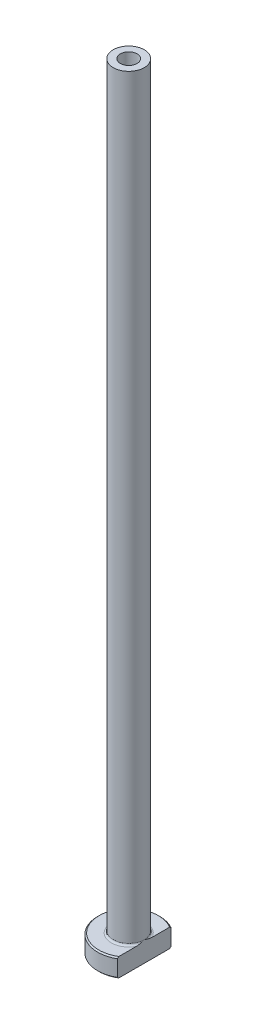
from build123d import *

# Parameters (mm, degrees)
FILLET1_R          = 0.3
CHAMFER1_SIZE      = 0.2
CUT_EXTRUDE1_DEPTH = 126.199840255
CHAMFER2_SIZE      = 0.5


with BuildPart() as part:
    # Sketch1 → Revolve1 (revolve)
    with BuildSketch(Plane.XY, mode=Mode.PRIVATE) as revolve1_sk:
        Polygon((-1.35, 125), (-2.5, 125), (-2.5, 3), (-5, 3), (-5, 0), (-1.6, 0), (-1.6, 68), (-1.35, 80), align=None)
    revolve(revolve1_sk.sketch.rotate(Axis((0, 92.187680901, 0), (0, -1, 0)), 270), axis=Axis((0, 92.187680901, 0), (0, -1, 0)))

    # Fillet1
    fillet1_edges = [part.edges().sort_by_distance(p)[0] for p in [
        (0, 3, -2.5),
    ]]
    fillet(fillet1_edges, radius=FILLET1_R)

    # Chamfer1
    chamfer1_edges = [part.edges().sort_by_distance(p)[0] for p in [
        (0, 0, -5),
        (0, 3, -5),
    ]]
    chamfer(chamfer1_edges, length=CHAMFER1_SIZE)

    # Sketch2 → Cut-Extrude1 (cut, through all)
    with BuildSketch(Plane.XZ):
        with BuildLine():
            Line((2.5, 4.330127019), (2.5, -4.330127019))
            ThreePointArc((2.5, -4.330127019), (5, 0), (2.5, 4.330127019))
        make_face()
    extrude(amount=-CUT_EXTRUDE1_DEPTH, mode=Mode.SUBTRACT)

    # Chamfer2
    chamfer2_edges = [part.edges().sort_by_distance(p)[0] for p in [
        (0, 0, -1.6),
    ]]
    chamfer(chamfer2_edges, length=CHAMFER2_SIZE)


solid = part.part
